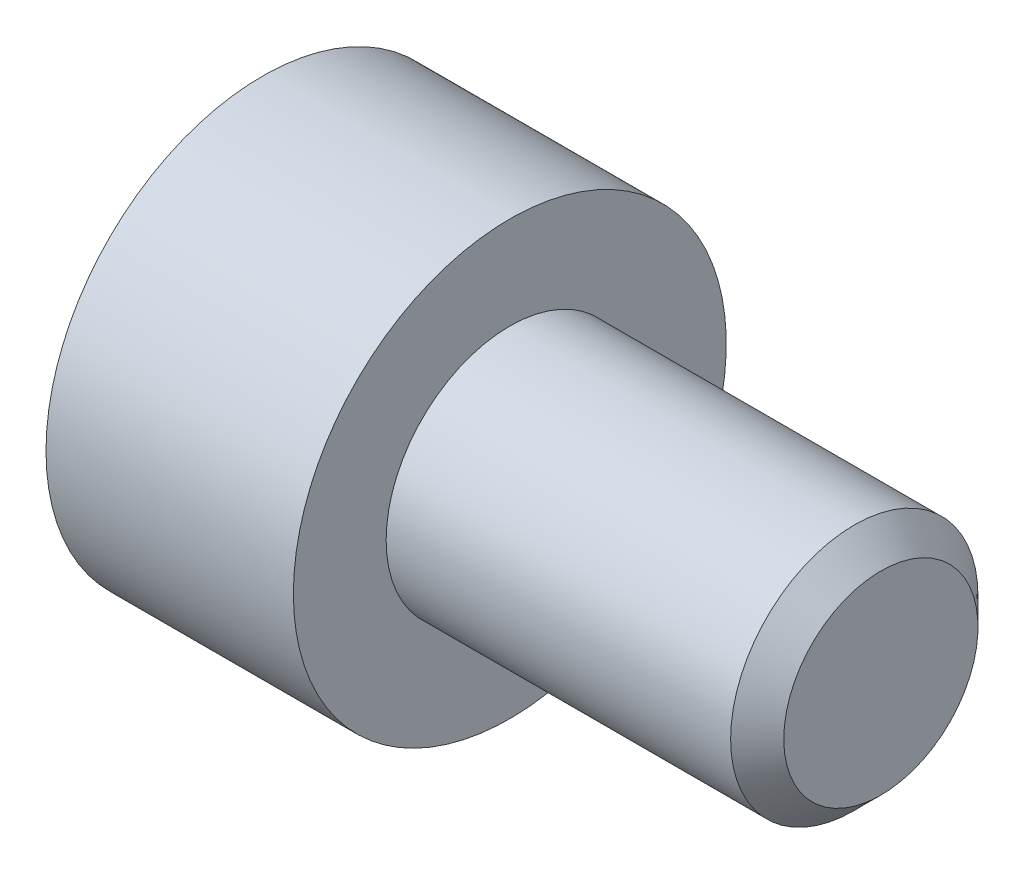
ISO-10303-21;
HEADER;
FILE_DESCRIPTION(('STEP AP214'),'2;1');
FILE_NAME('part.step','',(''),(''),'','','');
FILE_SCHEMA(('AUTOMOTIVE_DESIGN { 1 0 10303 214 1 1 1 1 }'));
ENDSEC;
DATA;
#1=APPLICATION_CONTEXT('core data for automotive mechanical design processes');
#2=APPLICATION_PROTOCOL_DEFINITION('international standard','automotive_design',2000,#1);
#3=PRODUCT_CONTEXT('',#1,'mechanical');
#4=PRODUCT('Part','Part','',(#3));
#5=PRODUCT_RELATED_PRODUCT_CATEGORY('part','',(#4));
#6=PRODUCT_DEFINITION_FORMATION('','',#4);
#7=PRODUCT_DEFINITION_CONTEXT('part definition',#1,'design');
#8=PRODUCT_DEFINITION('design','',#6,#7);
#9=PRODUCT_DEFINITION_SHAPE('','',#8);
#10=(LENGTH_UNIT() NAMED_UNIT(*) SI_UNIT(.MILLI.,.METRE.));
#11=(NAMED_UNIT(*) PLANE_ANGLE_UNIT() SI_UNIT($,.RADIAN.));
#12=(NAMED_UNIT(*) SI_UNIT($,.STERADIAN.) SOLID_ANGLE_UNIT());
#13=UNCERTAINTY_MEASURE_WITH_UNIT(LENGTH_MEASURE(1.E-05),#10,'distance_accuracy_value','');
#14=(GEOMETRIC_REPRESENTATION_CONTEXT(3) GLOBAL_UNCERTAINTY_ASSIGNED_CONTEXT((#13)) GLOBAL_UNIT_ASSIGNED_CONTEXT((#10,
#11,#12)) REPRESENTATION_CONTEXT('',''));
#15=CARTESIAN_POINT('',(0.,0.,0.));
#16=DIRECTION('',(0.,0.,1.));
#17=DIRECTION('',(1.,0.,0.));
#18=AXIS2_PLACEMENT_3D('',#15,#16,#17);
#19=CARTESIAN_POINT('',(-2.,0.86602540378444,1.5));
#20=DIRECTION('',(1.,0.,0.));
#21=DIRECTION('',(0.,0.,-1.));
#22=AXIS2_PLACEMENT_3D('',#19,#20,#21);
#23=PLANE('',#22);
#24=DIRECTION('',(0.,-0.500000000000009,0.866025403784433));
#25=VECTOR('',#24,1.);
#26=CARTESIAN_POINT('',(-2.,1.7320508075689,0.));
#27=LINE('',#26,#25);
#28=CARTESIAN_POINT('',(-2.,1.7320508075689,0.));
#29=VERTEX_POINT('',#28);
#30=CARTESIAN_POINT('',(-2.,0.86602540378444,1.5));
#31=VERTEX_POINT('',#30);
#32=EDGE_CURVE('E132',#29,#31,#27,.T.);
#33=ORIENTED_EDGE('',*,*,#32,.F.);
#34=DIRECTION('',(0.,0.500000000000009,0.866025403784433));
#35=VECTOR('',#34,1.);
#36=CARTESIAN_POINT('',(-2.,0.86602540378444,-1.5));
#37=LINE('',#36,#35);
#38=CARTESIAN_POINT('',(-2.,0.86602540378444,-1.5));
#39=VERTEX_POINT('',#38);
#40=EDGE_CURVE('E54',#39,#29,#37,.T.);
#41=ORIENTED_EDGE('',*,*,#40,.F.);
#42=DIRECTION('',(0.,1.,0.));
#43=VECTOR('',#42,1.);
#44=CARTESIAN_POINT('',(-2.,-0.86602540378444,-1.5));
#45=LINE('',#44,#43);
#46=CARTESIAN_POINT('',(-2.,-0.86602540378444,-1.5));
#47=VERTEX_POINT('',#46);
#48=EDGE_CURVE('E104',#47,#39,#45,.T.);
#49=ORIENTED_EDGE('',*,*,#48,.F.);
#50=DIRECTION('',(0.,0.500000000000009,-0.866025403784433));
#51=VECTOR('',#50,1.);
#52=CARTESIAN_POINT('',(-2.,-1.7320508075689,0.));
#53=LINE('',#52,#51);
#54=CARTESIAN_POINT('',(-2.,-1.7320508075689,0.));
#55=VERTEX_POINT('',#54);
#56=EDGE_CURVE('E97',#55,#47,#53,.T.);
#57=ORIENTED_EDGE('',*,*,#56,.F.);
#58=DIRECTION('',(0.,-0.500000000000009,-0.866025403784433));
#59=VECTOR('',#58,1.);
#60=CARTESIAN_POINT('',(-2.,-0.86602540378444,1.5));
#61=LINE('',#60,#59);
#62=CARTESIAN_POINT('',(-2.,-0.86602540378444,1.5));
#63=VERTEX_POINT('',#62);
#64=EDGE_CURVE('E105',#63,#55,#61,.T.);
#65=ORIENTED_EDGE('',*,*,#64,.F.);
#66=DIRECTION('',(0.,-1.,0.));
#67=VECTOR('',#66,1.);
#68=CARTESIAN_POINT('',(-2.,0.86602540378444,1.5));
#69=LINE('',#68,#67);
#70=EDGE_CURVE('E86',#31,#63,#69,.T.);
#71=ORIENTED_EDGE('',*,*,#70,.F.);
#72=EDGE_LOOP('',(#33,#41,#49,#57,#65,#71));
#73=FACE_BOUND('',#72,.T.);
#74=CARTESIAN_POINT('',(-2.,0.,0.));
#75=DIRECTION('',(-1.,0.,0.));
#76=DIRECTION('',(0.,0.,1.));
#77=AXIS2_PLACEMENT_3D('',#74,#75,#76);
#78=CIRCLE('',#77,1.49);
#79=CARTESIAN_POINT('',(-2.,0.,1.49));
#80=VERTEX_POINT('',#79);
#81=EDGE_CURVE('E120',#80,#80,#78,.T.);
#82=ORIENTED_EDGE('',*,*,#81,.F.);
#83=EDGE_LOOP('',(#82));
#84=FACE_BOUND('',#83,.T.);
#85=ADVANCED_FACE('F31',(#73,#84),#23,.F.);
#86=CARTESIAN_POINT('',(-4.,0.,0.));
#87=DIRECTION('',(1.,0.,0.));
#88=DIRECTION('',(0.,0.,-1.));
#89=AXIS2_PLACEMENT_3D('',#86,#87,#88);
#90=PLANE('',#89);
#91=CARTESIAN_POINT('',(-4.,0.,0.));
#92=DIRECTION('',(-1.,0.,0.));
#93=DIRECTION('',(0.,0.,1.));
#94=AXIS2_PLACEMENT_3D('',#91,#92,#93);
#95=CIRCLE('',#94,3.5);
#96=CARTESIAN_POINT('',(-4.,0.,3.5));
#97=VERTEX_POINT('',#96);
#98=EDGE_CURVE('E11',#97,#97,#95,.T.);
#99=ORIENTED_EDGE('',*,*,#98,.T.);
#100=EDGE_LOOP('',(#99));
#101=FACE_BOUND('',#100,.T.);
#102=DIRECTION('',(0.,-0.500000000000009,0.866025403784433));
#103=VECTOR('',#102,1.);
#104=CARTESIAN_POINT('',(-4.,1.7320508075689,0.));
#105=LINE('',#104,#103);
#106=CARTESIAN_POINT('',(-4.,1.7320508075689,0.));
#107=VERTEX_POINT('',#106);
#108=CARTESIAN_POINT('',(-4.,0.86602540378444,1.5));
#109=VERTEX_POINT('',#108);
#110=EDGE_CURVE('E46',#107,#109,#105,.T.);
#111=ORIENTED_EDGE('',*,*,#110,.T.);
#112=DIRECTION('',(0.,-1.,0.));
#113=VECTOR('',#112,1.);
#114=CARTESIAN_POINT('',(-4.,0.86602540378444,1.5));
#115=LINE('',#114,#113);
#116=CARTESIAN_POINT('',(-4.,-0.86602540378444,1.5));
#117=VERTEX_POINT('',#116);
#118=EDGE_CURVE('E119',#109,#117,#115,.T.);
#119=ORIENTED_EDGE('',*,*,#118,.T.);
#120=DIRECTION('',(0.,-0.500000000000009,-0.866025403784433));
#121=VECTOR('',#120,1.);
#122=CARTESIAN_POINT('',(-4.,-0.86602540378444,1.5));
#123=LINE('',#122,#121);
#124=CARTESIAN_POINT('',(-4.,-1.7320508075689,0.));
#125=VERTEX_POINT('',#124);
#126=EDGE_CURVE('E123',#117,#125,#123,.T.);
#127=ORIENTED_EDGE('',*,*,#126,.T.);
#128=DIRECTION('',(0.,0.500000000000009,-0.866025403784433));
#129=VECTOR('',#128,1.);
#130=CARTESIAN_POINT('',(-4.,-1.7320508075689,0.));
#131=LINE('',#130,#129);
#132=CARTESIAN_POINT('',(-4.,-0.86602540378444,-1.5));
#133=VERTEX_POINT('',#132);
#134=EDGE_CURVE('E126',#125,#133,#131,.T.);
#135=ORIENTED_EDGE('',*,*,#134,.T.);
#136=DIRECTION('',(0.,1.,0.));
#137=VECTOR('',#136,1.);
#138=CARTESIAN_POINT('',(-4.,-0.86602540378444,-1.5));
#139=LINE('',#138,#137);
#140=CARTESIAN_POINT('',(-4.,0.86602540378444,-1.5));
#141=VERTEX_POINT('',#140);
#142=EDGE_CURVE('E109',#133,#141,#139,.T.);
#143=ORIENTED_EDGE('',*,*,#142,.T.);
#144=DIRECTION('',(0.,0.500000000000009,0.866025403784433));
#145=VECTOR('',#144,1.);
#146=CARTESIAN_POINT('',(-4.,0.86602540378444,-1.5));
#147=LINE('',#146,#145);
#148=EDGE_CURVE('E129',#141,#107,#147,.T.);
#149=ORIENTED_EDGE('',*,*,#148,.T.);
#150=EDGE_LOOP('',(#111,#119,#127,#135,#143,#149));
#151=FACE_BOUND('',#150,.T.);
#152=ADVANCED_FACE('F33',(#101,#151),#90,.F.);
#153=CARTESIAN_POINT('',(6.,0.,0.));
#154=DIRECTION('',(-1.,0.,0.));
#155=DIRECTION('',(0.,0.,1.));
#156=AXIS2_PLACEMENT_3D('',#153,#154,#155);
#157=CYLINDRICAL_SURFACE('',#156,3.5);
#158=ORIENTED_EDGE('',*,*,#98,.F.);
#159=EDGE_LOOP('',(#158));
#160=FACE_BOUND('',#159,.T.);
#161=CARTESIAN_POINT('',(0.,0.,0.));
#162=DIRECTION('',(-1.,0.,0.));
#163=DIRECTION('',(0.,0.,1.));
#164=AXIS2_PLACEMENT_3D('',#161,#162,#163);
#165=CIRCLE('',#164,3.5);
#166=CARTESIAN_POINT('',(0.,0.,3.5));
#167=VERTEX_POINT('',#166);
#168=EDGE_CURVE('E39',#167,#167,#165,.T.);
#169=ORIENTED_EDGE('',*,*,#168,.T.);
#170=EDGE_LOOP('',(#169));
#171=FACE_BOUND('',#170,.T.);
#172=ADVANCED_FACE('F151',(#160,#171),#157,.T.);
#173=CARTESIAN_POINT('',(0.,3.5,0.));
#174=DIRECTION('',(-1.,0.,0.));
#175=DIRECTION('',(0.,0.,1.));
#176=AXIS2_PLACEMENT_3D('',#173,#174,#175);
#177=PLANE('',#176);
#178=ORIENTED_EDGE('',*,*,#168,.F.);
#179=EDGE_LOOP('',(#178));
#180=FACE_BOUND('',#179,.T.);
#181=CARTESIAN_POINT('',(0.,0.,0.));
#182=DIRECTION('',(-1.,0.,0.));
#183=DIRECTION('',(0.,0.,1.));
#184=AXIS2_PLACEMENT_3D('',#181,#182,#183);
#185=CIRCLE('',#184,2.);
#186=CARTESIAN_POINT('',(0.,0.,2.));
#187=VERTEX_POINT('',#186);
#188=EDGE_CURVE('E146',#187,#187,#185,.T.);
#189=ORIENTED_EDGE('',*,*,#188,.T.);
#190=EDGE_LOOP('',(#189));
#191=FACE_BOUND('',#190,.T.);
#192=ADVANCED_FACE('F153',(#180,#191),#177,.F.);
#193=CARTESIAN_POINT('',(6.,0.,0.));
#194=DIRECTION('',(-1.,0.,0.));
#195=DIRECTION('',(0.,0.,1.));
#196=AXIS2_PLACEMENT_3D('',#193,#194,#195);
#197=CYLINDRICAL_SURFACE('',#196,2.);
#198=ORIENTED_EDGE('',*,*,#188,.F.);
#199=EDGE_LOOP('',(#198));
#200=FACE_BOUND('',#199,.T.);
#201=CARTESIAN_POINT('',(5.5705,0.,0.));
#202=DIRECTION('',(-1.,0.,0.));
#203=DIRECTION('',(0.,0.,1.));
#204=AXIS2_PLACEMENT_3D('',#201,#202,#203);
#205=CIRCLE('',#204,2.);
#206=CARTESIAN_POINT('',(5.5705,0.,2.));
#207=VERTEX_POINT('',#206);
#208=EDGE_CURVE('E143',#207,#207,#205,.T.);
#209=ORIENTED_EDGE('',*,*,#208,.T.);
#210=EDGE_LOOP('',(#209));
#211=FACE_BOUND('',#210,.T.);
#212=ADVANCED_FACE('F156',(#200,#211),#197,.T.);
#213=CARTESIAN_POINT('',(6.,0.,0.));
#214=DIRECTION('',(-1.,0.,0.));
#215=DIRECTION('',(0.,0.,1.));
#216=AXIS2_PLACEMENT_3D('',#213,#214,#215);
#217=CONICAL_SURFACE('',#216,1.5705,0.785398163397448);
#218=ORIENTED_EDGE('',*,*,#208,.F.);
#219=EDGE_LOOP('',(#218));
#220=FACE_BOUND('',#219,.T.);
#221=CARTESIAN_POINT('',(6.,0.,0.));
#222=DIRECTION('',(-1.,0.,0.));
#223=DIRECTION('',(0.,0.,1.));
#224=AXIS2_PLACEMENT_3D('',#221,#222,#223);
#225=CIRCLE('',#224,1.5705);
#226=CARTESIAN_POINT('',(6.,0.,1.5705));
#227=VERTEX_POINT('',#226);
#228=EDGE_CURVE('E140',#227,#227,#225,.T.);
#229=ORIENTED_EDGE('',*,*,#228,.T.);
#230=EDGE_LOOP('',(#229));
#231=FACE_BOUND('',#230,.T.);
#232=ADVANCED_FACE('F162',(#220,#231),#217,.T.);
#233=CARTESIAN_POINT('',(6.,1.5705,0.));
#234=DIRECTION('',(-1.,0.,0.));
#235=DIRECTION('',(0.,0.,1.));
#236=AXIS2_PLACEMENT_3D('',#233,#234,#235);
#237=PLANE('',#236);
#238=ORIENTED_EDGE('',*,*,#228,.F.);
#239=EDGE_LOOP('',(#238));
#240=FACE_BOUND('',#239,.T.);
#241=ADVANCED_FACE('F168',(#240),#237,.F.);
#242=CARTESIAN_POINT('',(-2.,1.7320508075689,0.));
#243=DIRECTION('',(0.,-0.866025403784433,-0.500000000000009));
#244=DIRECTION('',(0.,0.500000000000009,-0.866025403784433));
#245=AXIS2_PLACEMENT_3D('',#242,#243,#244);
#246=PLANE('',#245);
#247=ORIENTED_EDGE('',*,*,#110,.F.);
#248=DIRECTION('',(-1.,0.,0.));
#249=VECTOR('',#248,1.);
#250=CARTESIAN_POINT('',(-2.,1.7320508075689,0.));
#251=LINE('',#250,#249);
#252=EDGE_CURVE('E114',#29,#107,#251,.T.);
#253=ORIENTED_EDGE('',*,*,#252,.F.);
#254=ORIENTED_EDGE('',*,*,#32,.T.);
#255=DIRECTION('',(-1.,0.,0.));
#256=VECTOR('',#255,1.);
#257=CARTESIAN_POINT('',(-2.,0.86602540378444,1.5));
#258=LINE('',#257,#256);
#259=EDGE_CURVE('E138',#31,#109,#258,.T.);
#260=ORIENTED_EDGE('',*,*,#259,.T.);
#261=EDGE_LOOP('',(#247,#253,#254,#260));
#262=FACE_BOUND('',#261,.T.);
#263=ADVANCED_FACE('F173',(#262),#246,.T.);
#264=CARTESIAN_POINT('',(-2.,0.86602540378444,1.5));
#265=DIRECTION('',(0.,0.,-1.));
#266=DIRECTION('',(-1.,0.,0.));
#267=AXIS2_PLACEMENT_3D('',#264,#265,#266);
#268=PLANE('',#267);
#269=ORIENTED_EDGE('',*,*,#118,.F.);
#270=ORIENTED_EDGE('',*,*,#259,.F.);
#271=ORIENTED_EDGE('',*,*,#70,.T.);
#272=DIRECTION('',(-1.,0.,0.));
#273=VECTOR('',#272,1.);
#274=CARTESIAN_POINT('',(-2.,-0.86602540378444,1.5));
#275=LINE('',#274,#273);
#276=EDGE_CURVE('E136',#63,#117,#275,.T.);
#277=ORIENTED_EDGE('',*,*,#276,.T.);
#278=EDGE_LOOP('',(#269,#270,#271,#277));
#279=FACE_BOUND('',#278,.T.);
#280=ADVANCED_FACE('F178',(#279),#268,.T.);
#281=CARTESIAN_POINT('',(-2.,-0.86602540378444,1.5));
#282=DIRECTION('',(0.,0.866025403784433,-0.500000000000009));
#283=DIRECTION('',(0.,0.500000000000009,0.866025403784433));
#284=AXIS2_PLACEMENT_3D('',#281,#282,#283);
#285=PLANE('',#284);
#286=ORIENTED_EDGE('',*,*,#126,.F.);
#287=ORIENTED_EDGE('',*,*,#276,.F.);
#288=ORIENTED_EDGE('',*,*,#64,.T.);
#289=DIRECTION('',(-1.,0.,0.));
#290=VECTOR('',#289,1.);
#291=CARTESIAN_POINT('',(-2.,-1.7320508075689,0.));
#292=LINE('',#291,#290);
#293=EDGE_CURVE('E102',#55,#125,#292,.T.);
#294=ORIENTED_EDGE('',*,*,#293,.T.);
#295=EDGE_LOOP('',(#286,#287,#288,#294));
#296=FACE_BOUND('',#295,.T.);
#297=ADVANCED_FACE('F196',(#296),#285,.T.);
#298=CARTESIAN_POINT('',(-2.,-1.7320508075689,0.));
#299=DIRECTION('',(0.,0.866025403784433,0.500000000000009));
#300=DIRECTION('',(0.,-0.500000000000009,0.866025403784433));
#301=AXIS2_PLACEMENT_3D('',#298,#299,#300);
#302=PLANE('',#301);
#303=ORIENTED_EDGE('',*,*,#134,.F.);
#304=ORIENTED_EDGE('',*,*,#293,.F.);
#305=ORIENTED_EDGE('',*,*,#56,.T.);
#306=DIRECTION('',(-1.,0.,0.));
#307=VECTOR('',#306,1.);
#308=CARTESIAN_POINT('',(-2.,-0.86602540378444,-1.5));
#309=LINE('',#308,#307);
#310=EDGE_CURVE('E101',#47,#133,#309,.T.);
#311=ORIENTED_EDGE('',*,*,#310,.T.);
#312=EDGE_LOOP('',(#303,#304,#305,#311));
#313=FACE_BOUND('',#312,.T.);
#314=ADVANCED_FACE('F100',(#313),#302,.T.);
#315=CARTESIAN_POINT('',(-2.,-0.86602540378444,-1.5));
#316=DIRECTION('',(0.,0.,1.));
#317=DIRECTION('',(1.,0.,0.));
#318=AXIS2_PLACEMENT_3D('',#315,#316,#317);
#319=PLANE('',#318);
#320=ORIENTED_EDGE('',*,*,#142,.F.);
#321=ORIENTED_EDGE('',*,*,#310,.F.);
#322=ORIENTED_EDGE('',*,*,#48,.T.);
#323=DIRECTION('',(-1.,0.,0.));
#324=VECTOR('',#323,1.);
#325=CARTESIAN_POINT('',(-2.,0.86602540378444,-1.5));
#326=LINE('',#325,#324);
#327=EDGE_CURVE('E77',#39,#141,#326,.T.);
#328=ORIENTED_EDGE('',*,*,#327,.T.);
#329=EDGE_LOOP('',(#320,#321,#322,#328));
#330=FACE_BOUND('',#329,.T.);
#331=ADVANCED_FACE('F107',(#330),#319,.T.);
#332=CARTESIAN_POINT('',(-2.,0.86602540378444,-1.5));
#333=DIRECTION('',(0.,-0.866025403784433,0.500000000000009));
#334=DIRECTION('',(0.,-0.500000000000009,-0.866025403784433));
#335=AXIS2_PLACEMENT_3D('',#332,#333,#334);
#336=PLANE('',#335);
#337=ORIENTED_EDGE('',*,*,#148,.F.);
#338=ORIENTED_EDGE('',*,*,#327,.F.);
#339=ORIENTED_EDGE('',*,*,#40,.T.);
#340=ORIENTED_EDGE('',*,*,#252,.T.);
#341=EDGE_LOOP('',(#337,#338,#339,#340));
#342=FACE_BOUND('',#341,.T.);
#343=ADVANCED_FACE('F189',(#342),#336,.T.);
#344=CARTESIAN_POINT('',(-1.1397480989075,0.,0.));
#345=DIRECTION('',(-1.,0.,0.));
#346=DIRECTION('',(0.,0.,1.));
#347=AXIS2_PLACEMENT_3D('',#344,#345,#346);
#348=CONICAL_SURFACE('',#347,0.,1.04719755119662);
#349=ORIENTED_EDGE('',*,*,#81,.T.);
#350=EDGE_LOOP('',(#349));
#351=FACE_BOUND('',#350,.T.);
#352=CARTESIAN_POINT('',(-1.1397480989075,0.,0.));
#353=VERTEX_POINT('',#352);
#354=VERTEX_LOOP('',#353);
#355=FACE_BOUND('',#354,.T.);
#356=ADVANCED_FACE('F188',(#351,#355),#348,.F.);
#357=CLOSED_SHELL('',(#85,#152,#172,#192,#212,#232,#241,#263,#280,#297,#314,#331,#343,#356));
#358=MANIFOLD_SOLID_BREP('B2',#357);
#359=ADVANCED_BREP_SHAPE_REPRESENTATION('',(#18,#358),#14);
#360=SHAPE_DEFINITION_REPRESENTATION(#9,#359);
ENDSEC;
END-ISO-10303-21;
